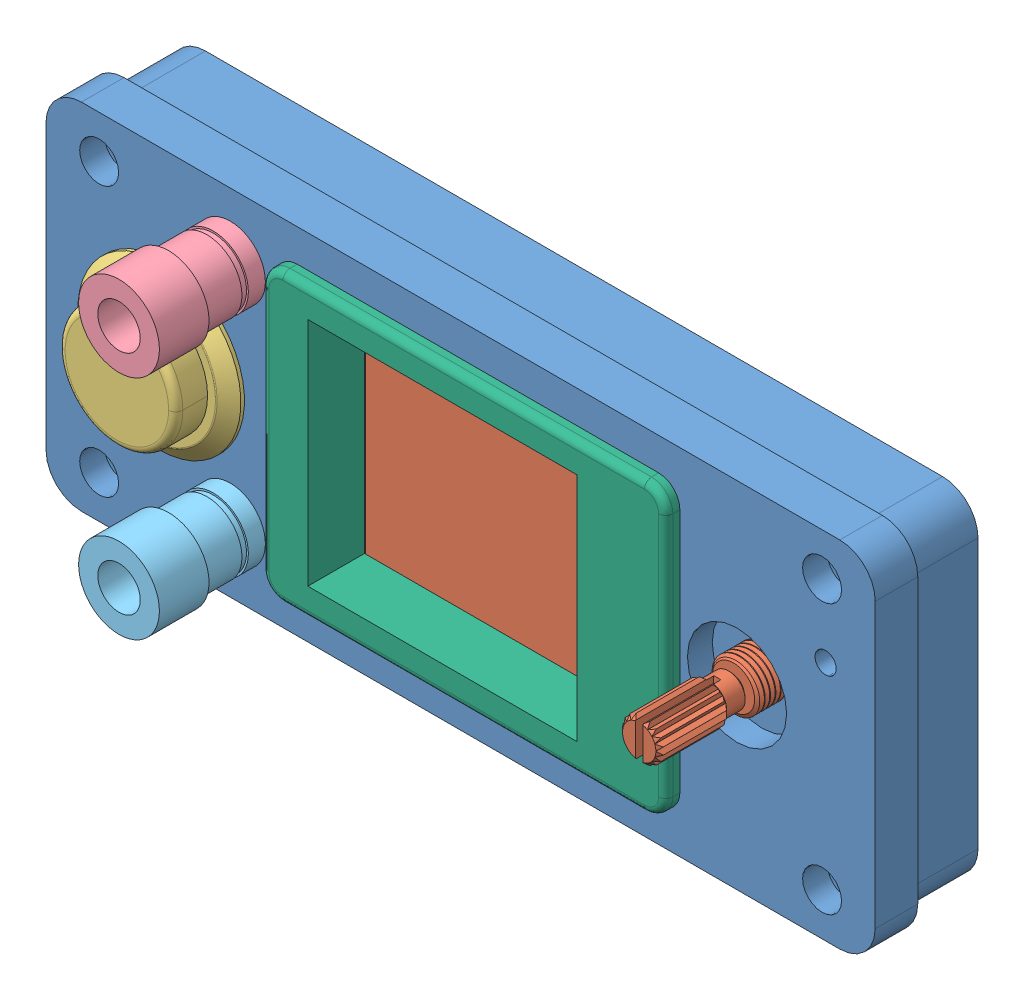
SolidWorks assembly FrontPanel.SLDASM, configuration Default (file format 4400). Lengths in mm.
Overall size (117 50 39.7).
6 component instances, 6 part files, 8 mates.
Components (placement in the parent):
- Front Pannel-1: Front Pannel.SLDPRT [Default] at (-55.1345 -21.3381 -2.2638) size (117 50 16)
- PCB-1: PCB.SLDPRT [Default] at (-23.1345 -16.3381 -9.1138) size (74 40 32.1)
- 4P-BUTTON1-1: 4P-BUTTON1.SLDPRT [Default] at (-38.6345 3.6619 -11.0638) x (1 0 0) z (0 -1 0) size (23 30.5 23)
- RedBanana-1: RedBanana.SLDPRT [Default] at (-29.1345 19.6619 6.1362) size (11.4 11.4 35.4)
- BlackBanana-1: BlackBanana.SLDPRT [Default] at (-29.1345 -12.3381 6.1362) size (11.4 11.4 35.4)
- LCD Frame-1: LCD Frame.SLDPRT [Default] at (-16.1952 -12.5205 -2.2638) size (57 40.6 8)
Mates (geometry in assembly coordinates):
- Distance1: distance = 0.5 mm anti-aligned: plane of PCB-1 through (50.8655 -16.3381 -10.6052) normal (1 0 0); plane of Front Pannel-1 through (51.3655 25.8619 -12.2638) normal (-1 0 0)
- Distance2: distance = 2.2 mm anti-aligned: plane of Front Pannel-1 through (51.3655 25.8619 -12.2638) normal (0 -1 0); plane of PCB-1 through (50.8655 23.6619 -10.6052) normal (0 1 0)
- Concentric1: concentric aligned: circle of Front Pannel-1; circle of 4P-BUTTON1-1
- Coincident6: coincident anti-aligned: plane of Front Pannel-1 through (-50.1345 -16.3381 3.7362) normal (0 0 1); plane of 4P-BUTTON1-1 through (-38.6345 3.6619 3.7362) normal (0 0 -1)
- Coincident7: coincident anti-aligned: plane of Front Pannel-1 through (-50.1345 -16.3381 3.7362) normal (0 0 1); plane of RedBanana-1 through (-29.1345 19.6619 3.7362) normal (0 0 -1)
- Concentric2: concentric anti-aligned: circle of BlackBanana-1; circle of Front Pannel-1
- Coincident8: coincident anti-aligned: plane of Front Pannel-1 through (-50.1345 -16.3381 3.7362) normal (0 0 1); circle of BlackBanana-1
- Coincident9: coincident aligned: plane of Front Pannel-1 through (-50.1345 -16.3381 -2.2638) normal (0 0 -1); plane of LCD Frame-1 through (-15.1952 -11.5205 -2.2638) normal (0 0 -1)
